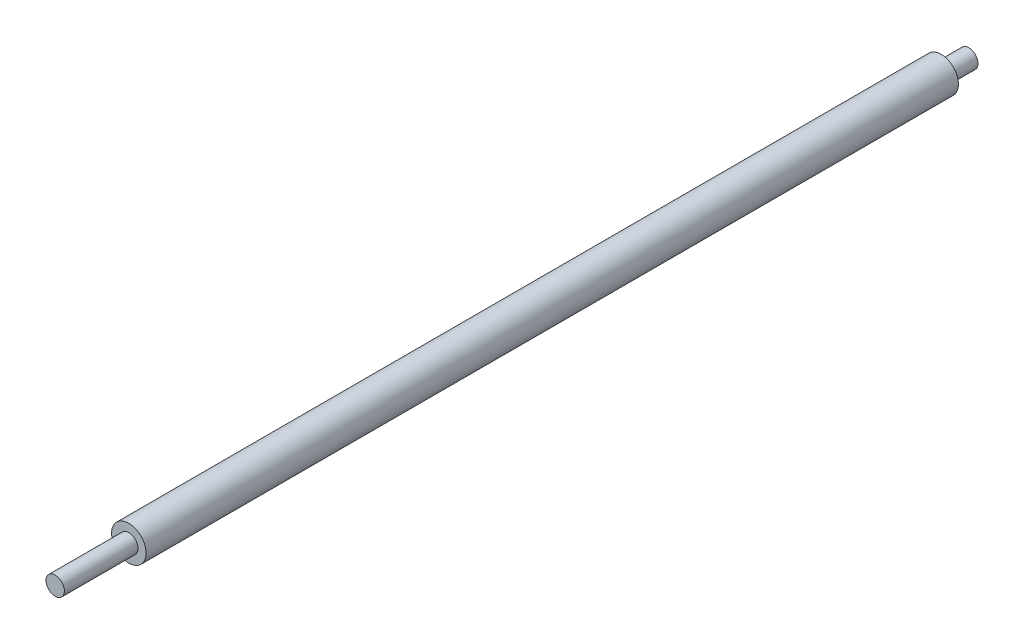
ISO-10303-21;
HEADER;
FILE_DESCRIPTION(('STEP AP214'),'2;1');
FILE_NAME('part.step','',(''),(''),'','','');
FILE_SCHEMA(('AUTOMOTIVE_DESIGN { 1 0 10303 214 1 1 1 1 }'));
ENDSEC;
DATA;
#1=APPLICATION_CONTEXT('core data for automotive mechanical design processes');
#2=APPLICATION_PROTOCOL_DEFINITION('international standard','automotive_design',2000,#1);
#3=PRODUCT_CONTEXT('',#1,'mechanical');
#4=PRODUCT('Part','Part','',(#3));
#5=PRODUCT_RELATED_PRODUCT_CATEGORY('part','',(#4));
#6=PRODUCT_DEFINITION_FORMATION('','',#4);
#7=PRODUCT_DEFINITION_CONTEXT('part definition',#1,'design');
#8=PRODUCT_DEFINITION('design','',#6,#7);
#9=PRODUCT_DEFINITION_SHAPE('','',#8);
#10=(LENGTH_UNIT() NAMED_UNIT(*) SI_UNIT(.MILLI.,.METRE.));
#11=(NAMED_UNIT(*) PLANE_ANGLE_UNIT() SI_UNIT($,.RADIAN.));
#12=(NAMED_UNIT(*) SI_UNIT($,.STERADIAN.) SOLID_ANGLE_UNIT());
#13=UNCERTAINTY_MEASURE_WITH_UNIT(LENGTH_MEASURE(1.E-05),#10,'distance_accuracy_value','');
#14=(GEOMETRIC_REPRESENTATION_CONTEXT(3) GLOBAL_UNCERTAINTY_ASSIGNED_CONTEXT((#13)) GLOBAL_UNIT_ASSIGNED_CONTEXT((#10,
#11,#12)) REPRESENTATION_CONTEXT('',''));
#15=CARTESIAN_POINT('',(0.,0.,0.));
#16=DIRECTION('',(0.,0.,1.));
#17=DIRECTION('',(1.,0.,0.));
#18=AXIS2_PLACEMENT_3D('',#15,#16,#17);
#19=CARTESIAN_POINT('',(0.,0.,0.));
#20=DIRECTION('',(0.,0.,1.));
#21=DIRECTION('',(1.,0.,0.));
#22=AXIS2_PLACEMENT_3D('',#19,#20,#21);
#23=PLANE('',#22);
#24=CARTESIAN_POINT('',(0.,0.,0.));
#25=DIRECTION('',(0.,0.,1.));
#26=DIRECTION('',(1.,0.,0.));
#27=AXIS2_PLACEMENT_3D('',#24,#25,#26);
#28=CIRCLE('',#27,7.5);
#29=CARTESIAN_POINT('',(7.5,0.,0.));
#30=VERTEX_POINT('',#29);
#31=EDGE_CURVE('E39',#30,#30,#28,.T.);
#32=ORIENTED_EDGE('',*,*,#31,.F.);
#33=EDGE_LOOP('',(#32));
#34=FACE_BOUND('',#33,.T.);
#35=CARTESIAN_POINT('',(0.,0.,0.));
#36=DIRECTION('',(0.,0.,1.));
#37=DIRECTION('',(1.,0.,0.));
#38=AXIS2_PLACEMENT_3D('',#35,#36,#37);
#39=CIRCLE('',#38,4.);
#40=CARTESIAN_POINT('',(4.,0.,0.));
#41=VERTEX_POINT('',#40);
#42=EDGE_CURVE('E10',#41,#41,#39,.F.);
#43=ORIENTED_EDGE('',*,*,#42,.F.);
#44=EDGE_LOOP('',(#43));
#45=FACE_BOUND('',#44,.T.);
#46=ADVANCED_FACE('F28',(#34,#45),#23,.F.);
#47=CARTESIAN_POINT('',(0.,0.,353.));
#48=DIRECTION('',(0.,0.,1.));
#49=DIRECTION('',(1.,0.,0.));
#50=AXIS2_PLACEMENT_3D('',#47,#48,#49);
#51=PLANE('',#50);
#52=CARTESIAN_POINT('',(0.,0.,353.));
#53=DIRECTION('',(0.,0.,1.));
#54=DIRECTION('',(1.,0.,0.));
#55=AXIS2_PLACEMENT_3D('',#52,#53,#54);
#56=CIRCLE('',#55,7.5);
#57=CARTESIAN_POINT('',(7.5,0.,353.));
#58=VERTEX_POINT('',#57);
#59=EDGE_CURVE('E35',#58,#58,#56,.T.);
#60=ORIENTED_EDGE('',*,*,#59,.T.);
#61=EDGE_LOOP('',(#60));
#62=FACE_BOUND('',#61,.T.);
#63=CARTESIAN_POINT('',(0.,0.,353.));
#64=DIRECTION('',(0.,0.,1.));
#65=DIRECTION('',(1.,0.,0.));
#66=AXIS2_PLACEMENT_3D('',#63,#64,#65);
#67=CIRCLE('',#66,4.);
#68=CARTESIAN_POINT('',(4.,0.,353.));
#69=VERTEX_POINT('',#68);
#70=EDGE_CURVE('E46',#69,#69,#67,.T.);
#71=ORIENTED_EDGE('',*,*,#70,.F.);
#72=EDGE_LOOP('',(#71));
#73=FACE_BOUND('',#72,.T.);
#74=ADVANCED_FACE('F70',(#62,#73),#51,.T.);
#75=CARTESIAN_POINT('',(0.,0.,353.));
#76=DIRECTION('',(0.,0.,-1.));
#77=DIRECTION('',(-1.,0.,0.));
#78=AXIS2_PLACEMENT_3D('',#75,#76,#77);
#79=CYLINDRICAL_SURFACE('',#78,7.5);
#80=ORIENTED_EDGE('',*,*,#59,.F.);
#81=EDGE_LOOP('',(#80));
#82=FACE_BOUND('',#81,.T.);
#83=ORIENTED_EDGE('',*,*,#31,.T.);
#84=EDGE_LOOP('',(#83));
#85=FACE_BOUND('',#84,.T.);
#86=ADVANCED_FACE('F30',(#82,#85),#79,.T.);
#87=CARTESIAN_POINT('',(0.,0.,385.));
#88=DIRECTION('',(0.,0.,-1.));
#89=DIRECTION('',(-1.,0.,0.));
#90=AXIS2_PLACEMENT_3D('',#87,#88,#89);
#91=CYLINDRICAL_SURFACE('',#90,4.);
#92=CARTESIAN_POINT('',(0.,0.,385.));
#93=DIRECTION('',(0.,0.,1.));
#94=DIRECTION('',(1.,0.,0.));
#95=AXIS2_PLACEMENT_3D('',#92,#93,#94);
#96=CIRCLE('',#95,4.);
#97=CARTESIAN_POINT('',(4.,0.,385.));
#98=VERTEX_POINT('',#97);
#99=EDGE_CURVE('E44',#98,#98,#96,.T.);
#100=ORIENTED_EDGE('',*,*,#99,.F.);
#101=EDGE_LOOP('',(#100));
#102=FACE_BOUND('',#101,.T.);
#103=ORIENTED_EDGE('',*,*,#70,.T.);
#104=EDGE_LOOP('',(#103));
#105=FACE_BOUND('',#104,.T.);
#106=ADVANCED_FACE('F66',(#102,#105),#91,.T.);
#107=CARTESIAN_POINT('',(0.,0.,385.));
#108=DIRECTION('',(0.,0.,1.));
#109=DIRECTION('',(1.,0.,0.));
#110=AXIS2_PLACEMENT_3D('',#107,#108,#109);
#111=PLANE('',#110);
#112=ORIENTED_EDGE('',*,*,#99,.T.);
#113=EDGE_LOOP('',(#112));
#114=FACE_BOUND('',#113,.T.);
#115=ADVANCED_FACE('F59',(#114),#111,.T.);
#116=CARTESIAN_POINT('',(0.,0.,-12.));
#117=DIRECTION('',(0.,0.,1.));
#118=DIRECTION('',(1.,0.,0.));
#119=AXIS2_PLACEMENT_3D('',#116,#117,#118);
#120=CYLINDRICAL_SURFACE('',#119,4.);
#121=CARTESIAN_POINT('',(0.,0.,-12.));
#122=DIRECTION('',(0.,0.,-1.));
#123=DIRECTION('',(-1.,0.,0.));
#124=AXIS2_PLACEMENT_3D('',#121,#122,#123);
#125=CIRCLE('',#124,4.);
#126=CARTESIAN_POINT('',(-4.,0.,-12.));
#127=VERTEX_POINT('',#126);
#128=EDGE_CURVE('E49',#127,#127,#125,.T.);
#129=ORIENTED_EDGE('',*,*,#128,.F.);
#130=EDGE_LOOP('',(#129));
#131=FACE_BOUND('',#130,.T.);
#132=ORIENTED_EDGE('',*,*,#42,.T.);
#133=EDGE_LOOP('',(#132));
#134=FACE_BOUND('',#133,.T.);
#135=ADVANCED_FACE('F57',(#131,#134),#120,.T.);
#136=CARTESIAN_POINT('',(0.,0.,-12.));
#137=DIRECTION('',(0.,0.,-1.));
#138=DIRECTION('',(-1.,0.,0.));
#139=AXIS2_PLACEMENT_3D('',#136,#137,#138);
#140=PLANE('',#139);
#141=ORIENTED_EDGE('',*,*,#128,.T.);
#142=EDGE_LOOP('',(#141));
#143=FACE_BOUND('',#142,.T.);
#144=ADVANCED_FACE('F55',(#143),#140,.T.);
#145=CLOSED_SHELL('',(#46,#74,#86,#106,#115,#135,#144));
#146=MANIFOLD_SOLID_BREP('B2',#145);
#147=ADVANCED_BREP_SHAPE_REPRESENTATION('',(#18,#146),#14);
#148=SHAPE_DEFINITION_REPRESENTATION(#9,#147);
ENDSEC;
END-ISO-10303-21;
